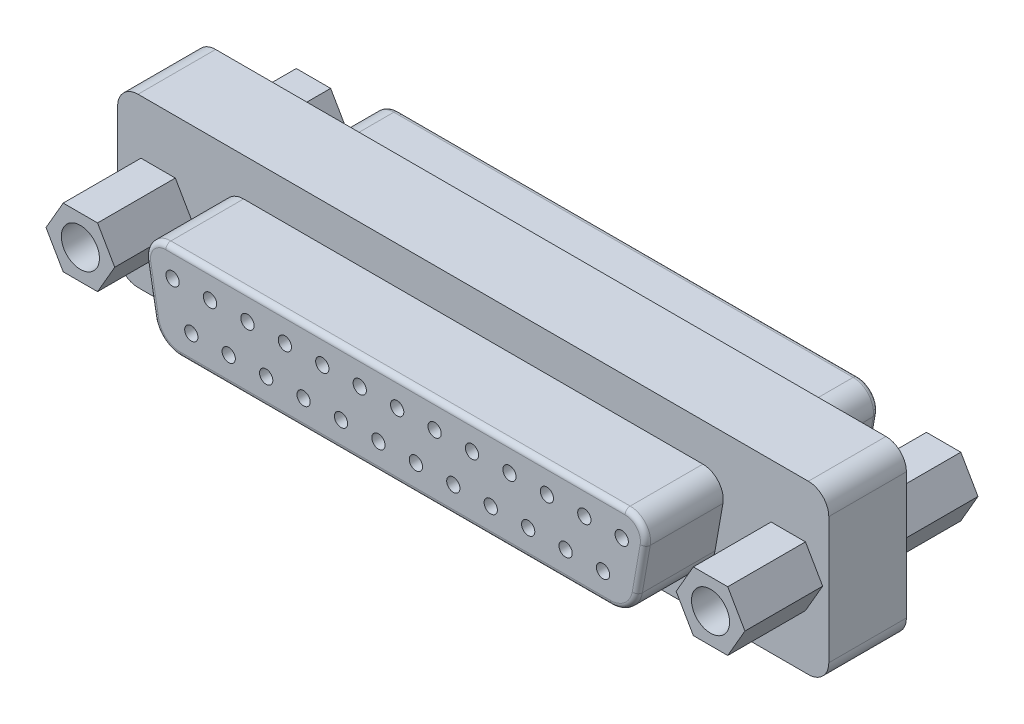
from build123d import *

# Parameters (mm, degrees)
FLANGE_BASE_EXTRUDE_DEPTH       = 2.8956
EXTRUDE3_DEPTH                  = 8.6995
EXTRUDE4_DEPTH                  = 5.8039
F_4_40_TAPPED_HOLE1_D           = 2.2606
F_4_40_TAPPED_HOLE1_DEPTH       = 7.5946
F_4_40_TAPPED_HOLE1_CBORE_D     = 2.8448
F_4_40_TAPPED_HOLE1_CBORE_DEPTH = 5.6896
F_4_40_TAPPED_HOLE1_TIP         = 0.679152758
F_4_40_TAPPED_HOLE2_D           = 2.2606
F_4_40_TAPPED_HOLE2_DEPTH       = 7.5946
F_4_40_TAPPED_HOLE2_CBORE_D     = 2.8448
F_4_40_TAPPED_HOLE2_CBORE_DEPTH = 5.6896
F_4_40_TAPPED_HOLE2_TIP         = 0.679152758
CUT_EXTRUDE1_REACH              = 34.347
SKETCH3_R                       = 0.4953
LPATTERN1_COUNT                 = 13
LPATTERN1_PITCH                 = 2.794
CUT_EXTRUDE2_REACH              = 34.347
SKETCH4_R                       = 0.4953
LPATTERN2_COUNT                 = 12
LPATTERN2_PITCH                 = 2.794
FILLET1_R                       = 0.381


with BuildPart() as part:
    # Sketch1 → Flange Base-Extrude (new, symmetric)
    with BuildSketch(Plane.XY):
        with BuildLine():
            Line((-25.019, 6.2484), (25.019, 6.2484))
            ThreePointArc((25.019, 6.2484), (26.096630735, 5.802030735), (26.543, 4.7244))
            Line((26.543, 4.7244), (26.543, -4.7244))
            ThreePointArc((26.543, -4.7244), (26.096630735, -5.802030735), (25.019, -6.2484))
            Line((25.019, -6.2484), (-25.019, -6.2484))
            ThreePointArc((-25.019, -6.2484), (-26.096630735, -5.802030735), (-26.543, -4.7244))
            Line((-26.543, -4.7244), (-26.543, 4.7244))
            ThreePointArc((-26.543, 4.7244), (-26.096630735, 5.802030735), (-25.019, 6.2484))
        make_face()
    extrude(amount=FLANGE_BASE_EXTRUDE_DEPTH, both=True)

    # Sketch2 → Extrude3 (add)
    with BuildSketch(Plane.XY):
        with BuildLine():
            Line((-18.6436, 1.627660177), (-18.050292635, -1.737153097))
            ThreePointArc((-18.050292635, -1.737153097), (-17.355307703, -2.940902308), (-16.049163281, -3.4163))
            Line((-16.049163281, -3.4163), (16.049163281, -3.4163))
            ThreePointArc((16.049163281, -3.4163), (17.355307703, -2.940902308), (18.050292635, -1.737153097))
            Line((18.050292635, -1.737153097), (18.6436, 1.627660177))
            ThreePointArc((18.6436, 1.627660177), (18.310204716, 2.871908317), (17.142752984, 3.4163))
            Line((17.142752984, 3.4163), (-17.142752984, 3.4163))
            ThreePointArc((-17.142752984, 3.4163), (-18.310204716, 2.871908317), (-18.6436, 1.627660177))
        make_face()
    extrude3 = extrude(amount=EXTRUDE3_DEPTH)

    # Sketch5 → Extrude4 (add)
    with BuildSketch(Plane.XY.offset(2.8956)):
        Polygon((-26.086721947, 0), (-24.803560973, -2.2225), (-22.237239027, -2.2225), (-20.954078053, 0), (-22.237239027, 2.2225), (-24.803560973, 2.2225), align=None)
        Polygon((24.803560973, 2.2225), (26.086721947, 0), (24.803560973, -2.2225), (22.237239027, -2.2225), (20.954078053, 0), (22.237239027, 2.2225), align=None)
    extrude4 = extrude(amount=EXTRUDE4_DEPTH)

    # 4-40 Tapped Hole1
    with Locations(Plane.XY.offset(8.6995)):
        with Locations((-23.5204, 0), (23.5204, 0)):
            CounterBoreHole(F_4_40_TAPPED_HOLE1_D / 2, F_4_40_TAPPED_HOLE1_CBORE_D / 2, F_4_40_TAPPED_HOLE1_CBORE_DEPTH, depth=F_4_40_TAPPED_HOLE1_DEPTH)
            with Locations((0, 0, -(F_4_40_TAPPED_HOLE1_DEPTH + F_4_40_TAPPED_HOLE1_TIP / 2))):  # 118° drill point
                Cone(0, F_4_40_TAPPED_HOLE1_D / 2, F_4_40_TAPPED_HOLE1_TIP, mode=Mode.SUBTRACT)

    # Mirror3: Extrude3, Extrude4 across plane
    add(extrude3.mirror(Plane.XY))
    add(extrude4.mirror(Plane.XY))

    # 4-40 Tapped Hole2
    with Locations(Plane(origin=(0, 0, -8.6995), x_dir=(-1, 0, 0), z_dir=(0, 0, -1))):
        with Locations((-23.5204, 0), (23.5204, 0)):
            CounterBoreHole(F_4_40_TAPPED_HOLE2_D / 2, F_4_40_TAPPED_HOLE2_CBORE_D / 2, F_4_40_TAPPED_HOLE2_CBORE_DEPTH, depth=F_4_40_TAPPED_HOLE2_DEPTH)
            with Locations((0, 0, -(F_4_40_TAPPED_HOLE2_DEPTH + F_4_40_TAPPED_HOLE2_TIP / 2))):  # 118° drill point
                Cone(0, F_4_40_TAPPED_HOLE2_D / 2, F_4_40_TAPPED_HOLE2_TIP, mode=Mode.SUBTRACT)

    # Sketch3 → Cut-Extrude1 (cut, up to next)
    with BuildSketch(Plane.XY.offset(8.6995), mode=Mode.PRIVATE) as cut_extrude1_sk1:
        with Locations((-16.637, 1.4224)):
            Circle(SKETCH3_R)
    cut_extrude1_tool1 = extrude(cut_extrude1_sk1.sketch, amount=-CUT_EXTRUDE1_REACH, mode=Mode.PRIVATE) & part.part
    cut_extrude1 = cut_extrude1_tool1.solids().sort_by_distance((-16.637, 1.4224, 8.6995))[0]
    add(cut_extrude1, mode=Mode.SUBTRACT)

    # LPattern1: Cut-Extrude1 ×13
    with Locations(*[(i * LPATTERN1_PITCH, 0, 0) for i in range(1, LPATTERN1_COUNT)]):
        add(cut_extrude1, mode=Mode.SUBTRACT)

    # Sketch4 → Cut-Extrude2 (cut, up to next)
    with BuildSketch(Plane.XY.offset(8.6995), mode=Mode.PRIVATE) as cut_extrude2_sk1:
        with Locations((-15.24, -1.4224)):
            Circle(SKETCH4_R)
    cut_extrude2_tool1 = extrude(cut_extrude2_sk1.sketch, amount=-CUT_EXTRUDE2_REACH, mode=Mode.PRIVATE) & part.part
    cut_extrude2 = cut_extrude2_tool1.solids().sort_by_distance((-15.24, -1.4224, 8.6995))[0]
    add(cut_extrude2, mode=Mode.SUBTRACT)

    # LPattern2: Cut-Extrude2 ×12
    with Locations(*[(i * LPATTERN2_PITCH, 0, 0) for i in range(1, LPATTERN2_COUNT)]):
        add(cut_extrude2, mode=Mode.SUBTRACT)

    # Fillet1
    fillet1_edges = [part.edges().sort_by_distance(p)[0] for p in [
        (18.310204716, 2.871908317, -8.6995),
        (0, 3.4163, -8.6995),
        (-18.310204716, 2.871908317, -8.6995),
        (-18.346946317, -0.05474646, -8.6995),
        (-17.355307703, -2.940902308, -8.6995),
        (0, -3.4163, -8.6995),
        (17.355307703, -2.940902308, -8.6995),
        (18.346946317, -0.05474646, -8.6995),
        (18.310204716, 2.871908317, 8.6995),
        (0, 3.4163, 8.6995),
        (-18.310204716, 2.871908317, 8.6995),
        (-18.346946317, -0.05474646, 8.6995),
        (-17.355307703, -2.940902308, 8.6995),
        (0, -3.4163, 8.6995),
        (17.355307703, -2.940902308, 8.6995),
        (18.346946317, -0.05474646, 8.6995),
    ]]
    fillet(fillet1_edges, radius=FILLET1_R)


solid = part.part
